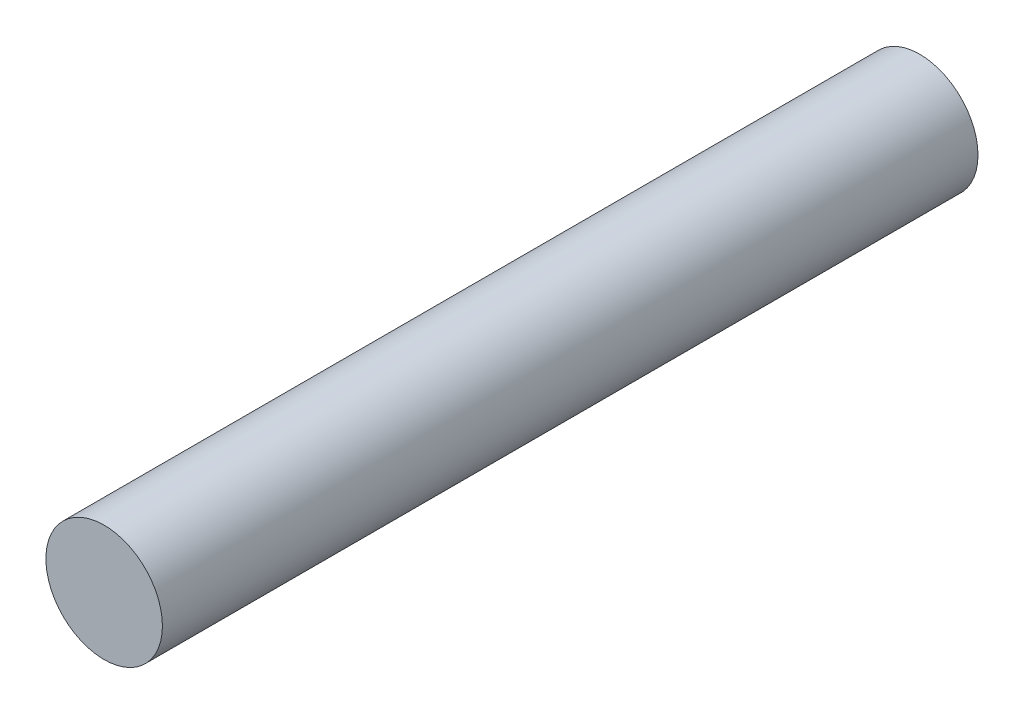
ISO-10303-21;
HEADER;
FILE_DESCRIPTION(('STEP AP214'),'2;1');
FILE_NAME('part.step','',(''),(''),'','','');
FILE_SCHEMA(('AUTOMOTIVE_DESIGN { 1 0 10303 214 1 1 1 1 }'));
ENDSEC;
DATA;
#1=APPLICATION_CONTEXT('core data for automotive mechanical design processes');
#2=APPLICATION_PROTOCOL_DEFINITION('international standard','automotive_design',2000,#1);
#3=PRODUCT_CONTEXT('',#1,'mechanical');
#4=PRODUCT('Part','Part','',(#3));
#5=PRODUCT_RELATED_PRODUCT_CATEGORY('part','',(#4));
#6=PRODUCT_DEFINITION_FORMATION('','',#4);
#7=PRODUCT_DEFINITION_CONTEXT('part definition',#1,'design');
#8=PRODUCT_DEFINITION('design','',#6,#7);
#9=PRODUCT_DEFINITION_SHAPE('','',#8);
#10=(LENGTH_UNIT() NAMED_UNIT(*) SI_UNIT(.MILLI.,.METRE.));
#11=(NAMED_UNIT(*) PLANE_ANGLE_UNIT() SI_UNIT($,.RADIAN.));
#12=(NAMED_UNIT(*) SI_UNIT($,.STERADIAN.) SOLID_ANGLE_UNIT());
#13=UNCERTAINTY_MEASURE_WITH_UNIT(LENGTH_MEASURE(1.E-05),#10,'distance_accuracy_value','');
#14=(GEOMETRIC_REPRESENTATION_CONTEXT(3) GLOBAL_UNCERTAINTY_ASSIGNED_CONTEXT((#13)) GLOBAL_UNIT_ASSIGNED_CONTEXT((#10,
#11,#12)) REPRESENTATION_CONTEXT('',''));
#15=CARTESIAN_POINT('',(0.,0.,0.));
#16=DIRECTION('',(0.,0.,1.));
#17=DIRECTION('',(1.,0.,0.));
#18=AXIS2_PLACEMENT_3D('',#15,#16,#17);
#19=CARTESIAN_POINT('',(-46.7719646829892,18.228617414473,44.45));
#20=DIRECTION('',(0.,0.,-1.));
#21=DIRECTION('',(-1.,0.,0.));
#22=AXIS2_PLACEMENT_3D('',#19,#20,#21);
#23=CYLINDRICAL_SURFACE('',#22,3.175);
#24=CARTESIAN_POINT('',(-46.7719646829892,18.228617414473,44.45));
#25=DIRECTION('',(0.,0.,1.));
#26=DIRECTION('',(1.,0.,0.));
#27=AXIS2_PLACEMENT_3D('',#24,#25,#26);
#28=CIRCLE('',#27,3.175);
#29=CARTESIAN_POINT('',(-43.5969646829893,18.228617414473,44.45));
#30=VERTEX_POINT('',#29);
#31=EDGE_CURVE('E10',#30,#30,#28,.T.);
#32=ORIENTED_EDGE('',*,*,#31,.F.);
#33=EDGE_LOOP('',(#32));
#34=FACE_BOUND('',#33,.T.);
#35=CARTESIAN_POINT('',(-46.7719646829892,18.228617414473,0.));
#36=DIRECTION('',(0.,0.,1.));
#37=DIRECTION('',(1.,0.,0.));
#38=AXIS2_PLACEMENT_3D('',#35,#36,#37);
#39=CIRCLE('',#38,3.175);
#40=CARTESIAN_POINT('',(-43.5969646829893,18.228617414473,0.));
#41=VERTEX_POINT('',#40);
#42=EDGE_CURVE('E34',#41,#41,#39,.T.);
#43=ORIENTED_EDGE('',*,*,#42,.T.);
#44=EDGE_LOOP('',(#43));
#45=FACE_BOUND('',#44,.T.);
#46=ADVANCED_FACE('F31',(#34,#45),#23,.T.);
#47=CARTESIAN_POINT('',(-46.7719646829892,18.228617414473,44.45));
#48=DIRECTION('',(0.,0.,1.));
#49=DIRECTION('',(1.,0.,0.));
#50=AXIS2_PLACEMENT_3D('',#47,#48,#49);
#51=PLANE('',#50);
#52=ORIENTED_EDGE('',*,*,#31,.T.);
#53=EDGE_LOOP('',(#52));
#54=FACE_BOUND('',#53,.T.);
#55=ADVANCED_FACE('F46',(#54),#51,.T.);
#56=CARTESIAN_POINT('',(-46.7719646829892,18.228617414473,0.));
#57=DIRECTION('',(0.,0.,1.));
#58=DIRECTION('',(1.,0.,0.));
#59=AXIS2_PLACEMENT_3D('',#56,#57,#58);
#60=PLANE('',#59);
#61=ORIENTED_EDGE('',*,*,#42,.F.);
#62=EDGE_LOOP('',(#61));
#63=FACE_BOUND('',#62,.T.);
#64=ADVANCED_FACE('F44',(#63),#60,.F.);
#65=CLOSED_SHELL('',(#46,#55,#64));
#66=MANIFOLD_SOLID_BREP('B2',#65);
#67=ADVANCED_BREP_SHAPE_REPRESENTATION('',(#18,#66),#14);
#68=SHAPE_DEFINITION_REPRESENTATION(#9,#67);
ENDSEC;
END-ISO-10303-21;
